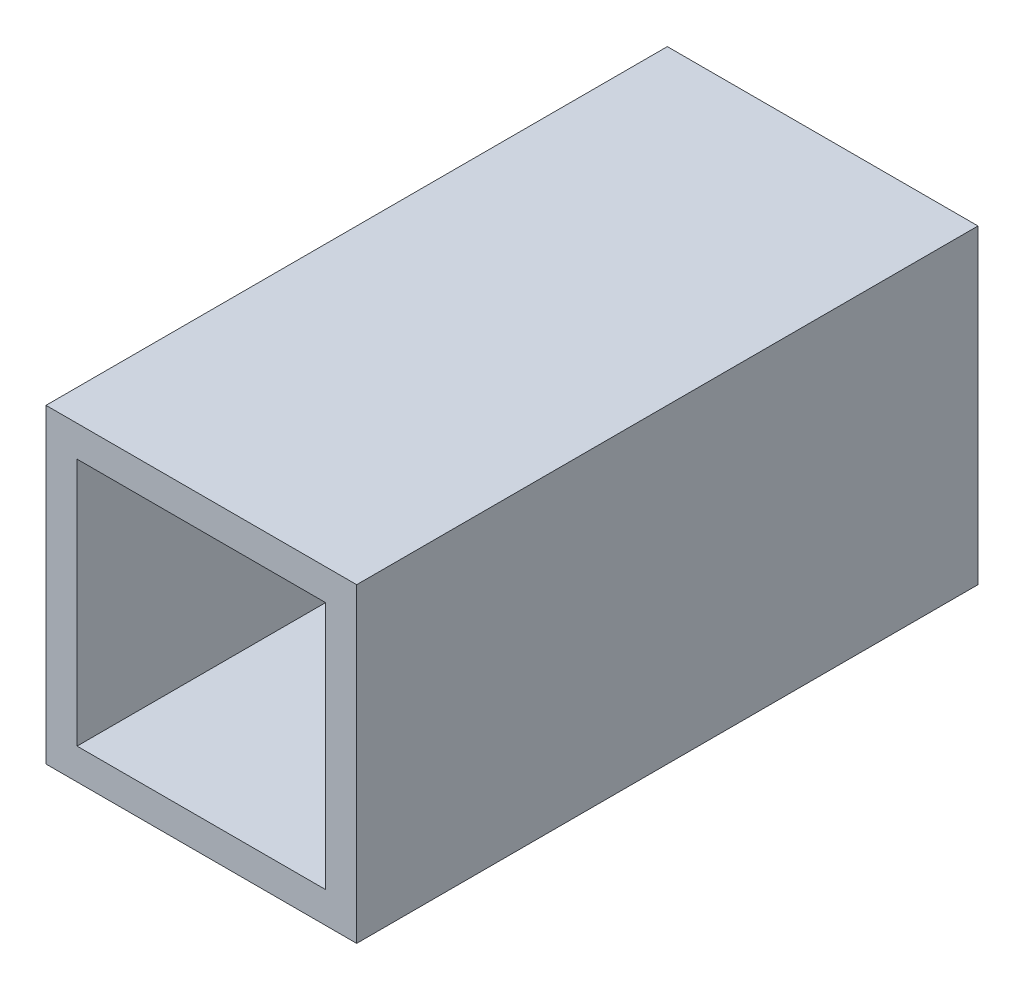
ISO-10303-21;
HEADER;
FILE_DESCRIPTION(('STEP AP214'),'2;1');
FILE_NAME('part.step','',(''),(''),'','','');
FILE_SCHEMA(('AUTOMOTIVE_DESIGN { 1 0 10303 214 1 1 1 1 }'));
ENDSEC;
DATA;
#1=APPLICATION_CONTEXT('core data for automotive mechanical design processes');
#2=APPLICATION_PROTOCOL_DEFINITION('international standard','automotive_design',2000,#1);
#3=PRODUCT_CONTEXT('',#1,'mechanical');
#4=PRODUCT('Part','Part','',(#3));
#5=PRODUCT_RELATED_PRODUCT_CATEGORY('part','',(#4));
#6=PRODUCT_DEFINITION_FORMATION('','',#4);
#7=PRODUCT_DEFINITION_CONTEXT('part definition',#1,'design');
#8=PRODUCT_DEFINITION('design','',#6,#7);
#9=PRODUCT_DEFINITION_SHAPE('','',#8);
#10=(LENGTH_UNIT() NAMED_UNIT(*) SI_UNIT(.MILLI.,.METRE.));
#11=(NAMED_UNIT(*) PLANE_ANGLE_UNIT() SI_UNIT($,.RADIAN.));
#12=(NAMED_UNIT(*) SI_UNIT($,.STERADIAN.) SOLID_ANGLE_UNIT());
#13=UNCERTAINTY_MEASURE_WITH_UNIT(LENGTH_MEASURE(1.E-05),#10,'distance_accuracy_value','');
#14=(GEOMETRIC_REPRESENTATION_CONTEXT(3) GLOBAL_UNCERTAINTY_ASSIGNED_CONTEXT((#13)) GLOBAL_UNIT_ASSIGNED_CONTEXT((#10,
#11,#12)) REPRESENTATION_CONTEXT('',''));
#15=CARTESIAN_POINT('',(0.,0.,0.));
#16=DIRECTION('',(0.,0.,1.));
#17=DIRECTION('',(1.,0.,0.));
#18=AXIS2_PLACEMENT_3D('',#15,#16,#17);
#19=CARTESIAN_POINT('',(0.,0.,200.));
#20=DIRECTION('',(0.,0.,1.));
#21=DIRECTION('',(1.,0.,0.));
#22=AXIS2_PLACEMENT_3D('',#19,#20,#21);
#23=PLANE('',#22);
#24=DIRECTION('',(0.,-1.,0.));
#25=VECTOR('',#24,1.);
#26=CARTESIAN_POINT('',(-40.,40.,200.));
#27=LINE('',#26,#25);
#28=CARTESIAN_POINT('',(-40.,40.,200.));
#29=VERTEX_POINT('',#28);
#30=CARTESIAN_POINT('',(-40.,-40.,200.));
#31=VERTEX_POINT('',#30);
#32=EDGE_CURVE('E25',#29,#31,#27,.T.);
#33=ORIENTED_EDGE('',*,*,#32,.F.);
#34=DIRECTION('',(-1.,0.,0.));
#35=VECTOR('',#34,1.);
#36=CARTESIAN_POINT('',(40.,40.,200.));
#37=LINE('',#36,#35);
#38=CARTESIAN_POINT('',(40.,40.,200.));
#39=VERTEX_POINT('',#38);
#40=EDGE_CURVE('E184',#39,#29,#37,.T.);
#41=ORIENTED_EDGE('',*,*,#40,.F.);
#42=DIRECTION('',(0.,1.,0.));
#43=VECTOR('',#42,1.);
#44=CARTESIAN_POINT('',(40.,-40.,200.));
#45=LINE('',#44,#43);
#46=CARTESIAN_POINT('',(40.,-40.,200.));
#47=VERTEX_POINT('',#46);
#48=EDGE_CURVE('E172',#47,#39,#45,.T.);
#49=ORIENTED_EDGE('',*,*,#48,.F.);
#50=DIRECTION('',(1.,0.,0.));
#51=VECTOR('',#50,1.);
#52=CARTESIAN_POINT('',(-40.,-40.,200.));
#53=LINE('',#52,#51);
#54=EDGE_CURVE('E139',#31,#47,#53,.T.);
#55=ORIENTED_EDGE('',*,*,#54,.F.);
#56=EDGE_LOOP('',(#33,#41,#49,#55));
#57=FACE_BOUND('',#56,.T.);
#58=DIRECTION('',(1.,0.,0.));
#59=VECTOR('',#58,1.);
#60=CARTESIAN_POINT('',(-50.,-50.,200.));
#61=LINE('',#60,#59);
#62=CARTESIAN_POINT('',(-50.,-50.,200.));
#63=VERTEX_POINT('',#62);
#64=CARTESIAN_POINT('',(50.,-50.,200.));
#65=VERTEX_POINT('',#64);
#66=EDGE_CURVE('E121',#63,#65,#61,.T.);
#67=ORIENTED_EDGE('',*,*,#66,.T.);
#68=DIRECTION('',(0.,1.,0.));
#69=VECTOR('',#68,1.);
#70=CARTESIAN_POINT('',(50.,-50.,200.));
#71=LINE('',#70,#69);
#72=CARTESIAN_POINT('',(50.,50.,200.));
#73=VERTEX_POINT('',#72);
#74=EDGE_CURVE('E155',#65,#73,#71,.T.);
#75=ORIENTED_EDGE('',*,*,#74,.T.);
#76=DIRECTION('',(-1.,0.,0.));
#77=VECTOR('',#76,1.);
#78=CARTESIAN_POINT('',(50.,50.,200.));
#79=LINE('',#78,#77);
#80=CARTESIAN_POINT('',(-50.,50.,200.));
#81=VERTEX_POINT('',#80);
#82=EDGE_CURVE('E113',#73,#81,#79,.T.);
#83=ORIENTED_EDGE('',*,*,#82,.T.);
#84=DIRECTION('',(0.,-1.,0.));
#85=VECTOR('',#84,1.);
#86=CARTESIAN_POINT('',(-50.,50.,200.));
#87=LINE('',#86,#85);
#88=EDGE_CURVE('E112',#81,#63,#87,.T.);
#89=ORIENTED_EDGE('',*,*,#88,.T.);
#90=EDGE_LOOP('',(#67,#75,#83,#89));
#91=FACE_BOUND('',#90,.T.);
#92=ADVANCED_FACE('F16',(#57,#91),#23,.T.);
#93=CARTESIAN_POINT('',(0.,0.,0.));
#94=DIRECTION('',(0.,0.,1.));
#95=DIRECTION('',(1.,0.,0.));
#96=AXIS2_PLACEMENT_3D('',#93,#94,#95);
#97=PLANE('',#96);
#98=DIRECTION('',(1.,0.,0.));
#99=VECTOR('',#98,1.);
#100=CARTESIAN_POINT('',(-40.,-40.,0.));
#101=LINE('',#100,#99);
#102=CARTESIAN_POINT('',(-40.,-40.,0.));
#103=VERTEX_POINT('',#102);
#104=CARTESIAN_POINT('',(40.,-40.,0.));
#105=VERTEX_POINT('',#104);
#106=EDGE_CURVE('E148',#103,#105,#101,.T.);
#107=ORIENTED_EDGE('',*,*,#106,.T.);
#108=DIRECTION('',(0.,1.,0.));
#109=VECTOR('',#108,1.);
#110=CARTESIAN_POINT('',(40.,-40.,0.));
#111=LINE('',#110,#109);
#112=CARTESIAN_POINT('',(40.,40.,0.));
#113=VERTEX_POINT('',#112);
#114=EDGE_CURVE('E180',#105,#113,#111,.T.);
#115=ORIENTED_EDGE('',*,*,#114,.T.);
#116=DIRECTION('',(-1.,0.,0.));
#117=VECTOR('',#116,1.);
#118=CARTESIAN_POINT('',(40.,40.,0.));
#119=LINE('',#118,#117);
#120=CARTESIAN_POINT('',(-40.,40.,0.));
#121=VERTEX_POINT('',#120);
#122=EDGE_CURVE('E191',#113,#121,#119,.T.);
#123=ORIENTED_EDGE('',*,*,#122,.T.);
#124=DIRECTION('',(0.,-1.,0.));
#125=VECTOR('',#124,1.);
#126=CARTESIAN_POINT('',(-40.,40.,0.));
#127=LINE('',#126,#125);
#128=EDGE_CURVE('E10',#121,#103,#127,.T.);
#129=ORIENTED_EDGE('',*,*,#128,.T.);
#130=EDGE_LOOP('',(#107,#115,#123,#129));
#131=FACE_BOUND('',#130,.T.);
#132=DIRECTION('',(0.,-1.,0.));
#133=VECTOR('',#132,1.);
#134=CARTESIAN_POINT('',(-50.,50.,0.));
#135=LINE('',#134,#133);
#136=CARTESIAN_POINT('',(-50.,50.,0.));
#137=VERTEX_POINT('',#136);
#138=CARTESIAN_POINT('',(-50.,-50.,0.));
#139=VERTEX_POINT('',#138);
#140=EDGE_CURVE('E101',#137,#139,#135,.T.);
#141=ORIENTED_EDGE('',*,*,#140,.F.);
#142=DIRECTION('',(-1.,0.,0.));
#143=VECTOR('',#142,1.);
#144=CARTESIAN_POINT('',(50.,50.,0.));
#145=LINE('',#144,#143);
#146=CARTESIAN_POINT('',(50.,50.,0.));
#147=VERTEX_POINT('',#146);
#148=EDGE_CURVE('E159',#147,#137,#145,.T.);
#149=ORIENTED_EDGE('',*,*,#148,.F.);
#150=DIRECTION('',(0.,1.,0.));
#151=VECTOR('',#150,1.);
#152=CARTESIAN_POINT('',(50.,-50.,0.));
#153=LINE('',#152,#151);
#154=CARTESIAN_POINT('',(50.,-50.,0.));
#155=VERTEX_POINT('',#154);
#156=EDGE_CURVE('E123',#155,#147,#153,.T.);
#157=ORIENTED_EDGE('',*,*,#156,.F.);
#158=DIRECTION('',(1.,0.,0.));
#159=VECTOR('',#158,1.);
#160=CARTESIAN_POINT('',(-50.,-50.,0.));
#161=LINE('',#160,#159);
#162=EDGE_CURVE('E119',#139,#155,#161,.T.);
#163=ORIENTED_EDGE('',*,*,#162,.F.);
#164=EDGE_LOOP('',(#141,#149,#157,#163));
#165=FACE_BOUND('',#164,.T.);
#166=ADVANCED_FACE('F125',(#131,#165),#97,.F.);
#167=CARTESIAN_POINT('',(-40.,40.,0.));
#168=DIRECTION('',(1.,0.,0.));
#169=DIRECTION('',(0.,1.,0.));
#170=AXIS2_PLACEMENT_3D('',#167,#168,#169);
#171=PLANE('',#170);
#172=DIRECTION('',(0.,0.,1.));
#173=VECTOR('',#172,1.);
#174=CARTESIAN_POINT('',(-40.,40.,0.));
#175=LINE('',#174,#173);
#176=EDGE_CURVE('E188',#121,#29,#175,.T.);
#177=ORIENTED_EDGE('',*,*,#176,.T.);
#178=ORIENTED_EDGE('',*,*,#32,.T.);
#179=DIRECTION('',(0.,0.,1.));
#180=VECTOR('',#179,1.);
#181=CARTESIAN_POINT('',(-40.,-40.,0.));
#182=LINE('',#181,#180);
#183=EDGE_CURVE('E142',#103,#31,#182,.T.);
#184=ORIENTED_EDGE('',*,*,#183,.F.);
#185=ORIENTED_EDGE('',*,*,#128,.F.);
#186=EDGE_LOOP('',(#177,#178,#184,#185));
#187=FACE_BOUND('',#186,.T.);
#188=ADVANCED_FACE('F18',(#187),#171,.T.);
#189=CARTESIAN_POINT('',(40.,40.,0.));
#190=DIRECTION('',(0.,-1.,0.));
#191=DIRECTION('',(0.,0.,-1.));
#192=AXIS2_PLACEMENT_3D('',#189,#190,#191);
#193=PLANE('',#192);
#194=DIRECTION('',(0.,0.,1.));
#195=VECTOR('',#194,1.);
#196=CARTESIAN_POINT('',(40.,40.,0.));
#197=LINE('',#196,#195);
#198=EDGE_CURVE('E176',#113,#39,#197,.T.);
#199=ORIENTED_EDGE('',*,*,#198,.T.);
#200=ORIENTED_EDGE('',*,*,#40,.T.);
#201=ORIENTED_EDGE('',*,*,#176,.F.);
#202=ORIENTED_EDGE('',*,*,#122,.F.);
#203=EDGE_LOOP('',(#199,#200,#201,#202));
#204=FACE_BOUND('',#203,.T.);
#205=ADVANCED_FACE('F204',(#204),#193,.T.);
#206=CARTESIAN_POINT('',(40.,-40.,0.));
#207=DIRECTION('',(-1.,0.,0.));
#208=DIRECTION('',(0.,0.,1.));
#209=AXIS2_PLACEMENT_3D('',#206,#207,#208);
#210=PLANE('',#209);
#211=DIRECTION('',(0.,0.,1.));
#212=VECTOR('',#211,1.);
#213=CARTESIAN_POINT('',(40.,-40.,0.));
#214=LINE('',#213,#212);
#215=EDGE_CURVE('E141',#105,#47,#214,.T.);
#216=ORIENTED_EDGE('',*,*,#215,.T.);
#217=ORIENTED_EDGE('',*,*,#48,.T.);
#218=ORIENTED_EDGE('',*,*,#198,.F.);
#219=ORIENTED_EDGE('',*,*,#114,.F.);
#220=EDGE_LOOP('',(#216,#217,#218,#219));
#221=FACE_BOUND('',#220,.T.);
#222=ADVANCED_FACE('F206',(#221),#210,.T.);
#223=CARTESIAN_POINT('',(-40.,-40.,0.));
#224=DIRECTION('',(0.,1.,0.));
#225=DIRECTION('',(1.,0.,0.));
#226=AXIS2_PLACEMENT_3D('',#223,#224,#225);
#227=PLANE('',#226);
#228=ORIENTED_EDGE('',*,*,#183,.T.);
#229=ORIENTED_EDGE('',*,*,#54,.T.);
#230=ORIENTED_EDGE('',*,*,#215,.F.);
#231=ORIENTED_EDGE('',*,*,#106,.F.);
#232=EDGE_LOOP('',(#228,#229,#230,#231));
#233=FACE_BOUND('',#232,.T.);
#234=ADVANCED_FACE('F200',(#233),#227,.T.);
#235=CARTESIAN_POINT('',(-50.,50.,0.));
#236=DIRECTION('',(1.,0.,0.));
#237=DIRECTION('',(0.,1.,0.));
#238=AXIS2_PLACEMENT_3D('',#235,#236,#237);
#239=PLANE('',#238);
#240=ORIENTED_EDGE('',*,*,#140,.T.);
#241=DIRECTION('',(0.,0.,1.));
#242=VECTOR('',#241,1.);
#243=CARTESIAN_POINT('',(-50.,-50.,0.));
#244=LINE('',#243,#242);
#245=EDGE_CURVE('E104',#139,#63,#244,.T.);
#246=ORIENTED_EDGE('',*,*,#245,.T.);
#247=ORIENTED_EDGE('',*,*,#88,.F.);
#248=DIRECTION('',(0.,0.,1.));
#249=VECTOR('',#248,1.);
#250=CARTESIAN_POINT('',(-50.,50.,0.));
#251=LINE('',#250,#249);
#252=EDGE_CURVE('E107',#137,#81,#251,.T.);
#253=ORIENTED_EDGE('',*,*,#252,.F.);
#254=EDGE_LOOP('',(#240,#246,#247,#253));
#255=FACE_BOUND('',#254,.T.);
#256=ADVANCED_FACE('F103',(#255),#239,.F.);
#257=CARTESIAN_POINT('',(50.,50.,0.));
#258=DIRECTION('',(0.,-1.,0.));
#259=DIRECTION('',(0.,0.,-1.));
#260=AXIS2_PLACEMENT_3D('',#257,#258,#259);
#261=PLANE('',#260);
#262=ORIENTED_EDGE('',*,*,#148,.T.);
#263=ORIENTED_EDGE('',*,*,#252,.T.);
#264=ORIENTED_EDGE('',*,*,#82,.F.);
#265=DIRECTION('',(0.,0.,1.));
#266=VECTOR('',#265,1.);
#267=CARTESIAN_POINT('',(50.,50.,0.));
#268=LINE('',#267,#266);
#269=EDGE_CURVE('E138',#147,#73,#268,.T.);
#270=ORIENTED_EDGE('',*,*,#269,.F.);
#271=EDGE_LOOP('',(#262,#263,#264,#270));
#272=FACE_BOUND('',#271,.T.);
#273=ADVANCED_FACE('F223',(#272),#261,.F.);
#274=CARTESIAN_POINT('',(50.,-50.,0.));
#275=DIRECTION('',(-1.,0.,0.));
#276=DIRECTION('',(0.,0.,1.));
#277=AXIS2_PLACEMENT_3D('',#274,#275,#276);
#278=PLANE('',#277);
#279=ORIENTED_EDGE('',*,*,#156,.T.);
#280=ORIENTED_EDGE('',*,*,#269,.T.);
#281=ORIENTED_EDGE('',*,*,#74,.F.);
#282=DIRECTION('',(0.,0.,1.));
#283=VECTOR('',#282,1.);
#284=CARTESIAN_POINT('',(50.,-50.,0.));
#285=LINE('',#284,#283);
#286=EDGE_CURVE('E129',#155,#65,#285,.T.);
#287=ORIENTED_EDGE('',*,*,#286,.F.);
#288=EDGE_LOOP('',(#279,#280,#281,#287));
#289=FACE_BOUND('',#288,.T.);
#290=ADVANCED_FACE('F229',(#289),#278,.F.);
#291=CARTESIAN_POINT('',(-50.,-50.,0.));
#292=DIRECTION('',(0.,1.,0.));
#293=DIRECTION('',(1.,0.,0.));
#294=AXIS2_PLACEMENT_3D('',#291,#292,#293);
#295=PLANE('',#294);
#296=ORIENTED_EDGE('',*,*,#162,.T.);
#297=ORIENTED_EDGE('',*,*,#286,.T.);
#298=ORIENTED_EDGE('',*,*,#66,.F.);
#299=ORIENTED_EDGE('',*,*,#245,.F.);
#300=EDGE_LOOP('',(#296,#297,#298,#299));
#301=FACE_BOUND('',#300,.T.);
#302=ADVANCED_FACE('F117',(#301),#295,.F.);
#303=CLOSED_SHELL('',(#92,#166,#188,#205,#222,#234,#256,#273,#290,#302));
#304=MANIFOLD_SOLID_BREP('B1',#303);
#305=ADVANCED_BREP_SHAPE_REPRESENTATION('',(#18,#304),#14);
#306=SHAPE_DEFINITION_REPRESENTATION(#9,#305);
ENDSEC;
END-ISO-10303-21;
